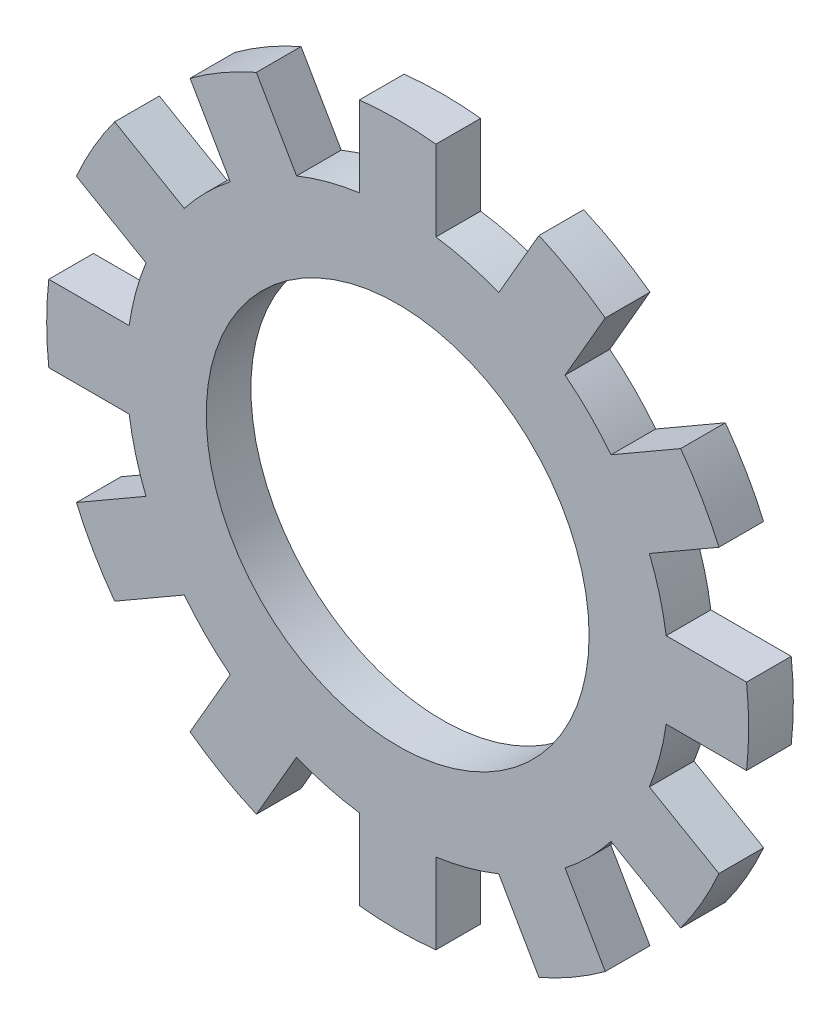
from build123d import *

# Parameters (mm, degrees)
SKETCH1_R                 = 4.25
SKETCH1_R_2               = 3
BOSS_EXTRUDE1_DEPTH       = 0.35
BOSS_EXTRUDE2_DEPTH       = 0.35
CIRPATTERN2_COUNT         = 12
CIRPATTERN2_COPY_1_DEPTH  = 0.35
CIRPATTERN2_COPY_2_DEPTH  = 0.35
CIRPATTERN2_COPY_3_DEPTH  = 0.35
CIRPATTERN2_COPY_4_DEPTH  = 0.35
CIRPATTERN2_COPY_5_DEPTH  = 0.35
CIRPATTERN2_COPY_6_DEPTH  = 0.35
CIRPATTERN2_COPY_7_DEPTH  = 0.35
CIRPATTERN2_COPY_8_DEPTH  = 0.35
CIRPATTERN2_COPY_9_DEPTH  = 0.35
CIRPATTERN2_COPY_10_DEPTH = 0.35
CIRPATTERN2_COPY_11_DEPTH = 0.35


with BuildPart() as part:
    # Sketch1 → Boss-Extrude1 (new, symmetric)
    with BuildSketch(Plane.XY):
        Circle(SKETCH1_R)
        Circle(SKETCH1_R_2, mode=Mode.SUBTRACT)
    extrude(amount=BOSS_EXTRUDE1_DEPTH, both=True)

    # Sketch3 → Boss-Extrude2 (add, symmetric)
    with BuildSketch(Plane.XY):
        with BuildLine():
            Line((-0.6, 5.467174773), (-0.6, 4.207433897))
            ThreePointArc((-0.6, 4.207433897), (-0.300754, 4.239345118), (0, 4.25))
            Line((0, 4.25), (0, 5.5))
            ThreePointArc((0, 5.5), (-0.300448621, 5.491787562), (-0.6, 5.467174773))
        make_face()
    boss_extrude2 = extrude(amount=BOSS_EXTRUDE2_DEPTH, both=True)

    # Mirror1: Boss-Extrude2 across plane
    add(boss_extrude2.mirror(Plane(origin=(0, 0, 0), x_dir=(0, 0, 1), z_dir=(1, 0, 0))))

    # CirPattern2: Boss-Extrude2 ×12 about axis
    cirpattern2_axis = Axis((0, 0, 0), (0, 0, 1))
    for i in range(1, CIRPATTERN2_COUNT):
        add(boss_extrude2.rotate(cirpattern2_axis, i * 360 / CIRPATTERN2_COUNT))

    # CirPattern2 copy 1 sketch → CirPattern2 copy 1 (add, symmetric)
    with BuildSketch(Plane(origin=(0, 0, 0), x_dir=(-0.8660254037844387, -0.49999999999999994, 0), z_dir=(0, 0, 1))):
        with BuildLine():
            Line((-0.6, -5.467174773), (-0.6, -4.207433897))
            ThreePointArc((-0.6, -4.207433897), (-0.300754, -4.239345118), (0, -4.25))
            Line((0, -4.25), (0, -5.5))
            ThreePointArc((0, -5.5), (-0.300448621, -5.491787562), (-0.6, -5.467174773))
        make_face()
    extrude(amount=CIRPATTERN2_COPY_1_DEPTH, both=True)

    # CirPattern2 copy 2 sketch → CirPattern2 copy 2 (add, symmetric)
    with BuildSketch(Plane(origin=(0, 0, 0), x_dir=(-0.5000000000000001, -0.8660254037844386, 0), z_dir=(0, 0, 1))):
        with BuildLine():
            Line((-0.6, -5.467174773), (-0.6, -4.207433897))
            ThreePointArc((-0.6, -4.207433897), (-0.300754, -4.239345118), (0, -4.25))
            Line((0, -4.25), (0, -5.5))
            ThreePointArc((0, -5.5), (-0.300448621, -5.491787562), (-0.6, -5.467174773))
        make_face()
    extrude(amount=CIRPATTERN2_COPY_2_DEPTH, both=True)

    # CirPattern2 copy 3 sketch → CirPattern2 copy 3 (add, symmetric)
    with BuildSketch(Plane(origin=(0, 0, 0), x_dir=(0, -1, 0), z_dir=(0, 0, 1))):
        with BuildLine():
            Line((-0.6, -5.467174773), (-0.6, -4.207433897))
            ThreePointArc((-0.6, -4.207433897), (-0.300754, -4.239345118), (0, -4.25))
            Line((0, -4.25), (0, -5.5))
            ThreePointArc((0, -5.5), (-0.300448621, -5.491787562), (-0.6, -5.467174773))
        make_face()
    extrude(amount=CIRPATTERN2_COPY_3_DEPTH, both=True)

    # CirPattern2 copy 4 sketch → CirPattern2 copy 4 (add, symmetric)
    with BuildSketch(Plane(origin=(0, 0, 0), x_dir=(0.4999999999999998, -0.8660254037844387, 0), z_dir=(0, 0, 1))):
        with BuildLine():
            Line((-0.6, -5.467174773), (-0.6, -4.207433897))
            ThreePointArc((-0.6, -4.207433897), (-0.300754, -4.239345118), (0, -4.25))
            Line((0, -4.25), (0, -5.5))
            ThreePointArc((0, -5.5), (-0.300448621, -5.491787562), (-0.6, -5.467174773))
        make_face()
    extrude(amount=CIRPATTERN2_COPY_4_DEPTH, both=True)

    # CirPattern2 copy 5 sketch → CirPattern2 copy 5 (add, symmetric)
    with BuildSketch(Plane(origin=(0, 0, 0), x_dir=(0.8660254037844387, -0.49999999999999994, 0), z_dir=(0, 0, 1))):
        with BuildLine():
            Line((-0.6, -5.467174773), (-0.6, -4.207433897))
            ThreePointArc((-0.6, -4.207433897), (-0.300754, -4.239345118), (0, -4.25))
            Line((0, -4.25), (0, -5.5))
            ThreePointArc((0, -5.5), (-0.300448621, -5.491787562), (-0.6, -5.467174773))
        make_face()
    extrude(amount=CIRPATTERN2_COPY_5_DEPTH, both=True)

    # CirPattern2 copy 6 sketch → CirPattern2 copy 6 (add, symmetric)
    with BuildSketch(Plane.XY):
        with BuildLine():
            Line((-0.6, -5.467174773), (-0.6, -4.207433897))
            ThreePointArc((-0.6, -4.207433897), (-0.300754, -4.239345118), (0, -4.25))
            Line((0, -4.25), (0, -5.5))
            ThreePointArc((0, -5.5), (-0.300448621, -5.491787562), (-0.6, -5.467174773))
        make_face()
    extrude(amount=CIRPATTERN2_COPY_6_DEPTH, both=True)

    # CirPattern2 copy 7 sketch → CirPattern2 copy 7 (add, symmetric)
    with BuildSketch(Plane(origin=(0, 0, 0), x_dir=(0.8660254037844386, 0.5000000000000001, 0), z_dir=(0, 0, 1))):
        with BuildLine():
            Line((-0.6, -5.467174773), (-0.6, -4.207433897))
            ThreePointArc((-0.6, -4.207433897), (-0.300754, -4.239345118), (0, -4.25))
            Line((0, -4.25), (0, -5.5))
            ThreePointArc((0, -5.5), (-0.300448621, -5.491787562), (-0.6, -5.467174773))
        make_face()
    extrude(amount=CIRPATTERN2_COPY_7_DEPTH, both=True)

    # CirPattern2 copy 8 sketch → CirPattern2 copy 8 (add, symmetric)
    with BuildSketch(Plane(origin=(0, 0, 0), x_dir=(0.5000000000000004, 0.8660254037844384, 0), z_dir=(0, 0, 1))):
        with BuildLine():
            Line((-0.6, -5.467174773), (-0.6, -4.207433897))
            ThreePointArc((-0.6, -4.207433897), (-0.300754, -4.239345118), (0, -4.25))
            Line((0, -4.25), (0, -5.5))
            ThreePointArc((0, -5.5), (-0.300448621, -5.491787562), (-0.6, -5.467174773))
        make_face()
    extrude(amount=CIRPATTERN2_COPY_8_DEPTH, both=True)

    # CirPattern2 copy 9 sketch → CirPattern2 copy 9 (add, symmetric)
    with BuildSketch(Plane(origin=(0, 0, 0), x_dir=(0, 1, 0), z_dir=(0, 0, 1))):
        with BuildLine():
            Line((-0.6, -5.467174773), (-0.6, -4.207433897))
            ThreePointArc((-0.6, -4.207433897), (-0.300754, -4.239345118), (0, -4.25))
            Line((0, -4.25), (0, -5.5))
            ThreePointArc((0, -5.5), (-0.300448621, -5.491787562), (-0.6, -5.467174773))
        make_face()
    extrude(amount=CIRPATTERN2_COPY_9_DEPTH, both=True)

    # CirPattern2 copy 10 sketch → CirPattern2 copy 10 (add, symmetric)
    with BuildSketch(Plane(origin=(0, 0, 0), x_dir=(-0.5000000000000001, 0.8660254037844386, 0), z_dir=(0, 0, 1))):
        with BuildLine():
            Line((-0.6, -5.467174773), (-0.6, -4.207433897))
            ThreePointArc((-0.6, -4.207433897), (-0.300754, -4.239345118), (0, -4.25))
            Line((0, -4.25), (0, -5.5))
            ThreePointArc((0, -5.5), (-0.300448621, -5.491787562), (-0.6, -5.467174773))
        make_face()
    extrude(amount=CIRPATTERN2_COPY_10_DEPTH, both=True)

    # CirPattern2 copy 11 sketch → CirPattern2 copy 11 (add, symmetric)
    with BuildSketch(Plane(origin=(0, 0, 0), x_dir=(-0.8660254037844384, 0.5000000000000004, 0), z_dir=(0, 0, 1))):
        with BuildLine():
            Line((-0.6, -5.467174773), (-0.6, -4.207433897))
            ThreePointArc((-0.6, -4.207433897), (-0.300754, -4.239345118), (0, -4.25))
            Line((0, -4.25), (0, -5.5))
            ThreePointArc((0, -5.5), (-0.300448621, -5.491787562), (-0.6, -5.467174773))
        make_face()
    extrude(amount=CIRPATTERN2_COPY_11_DEPTH, both=True)


solid = part.part
